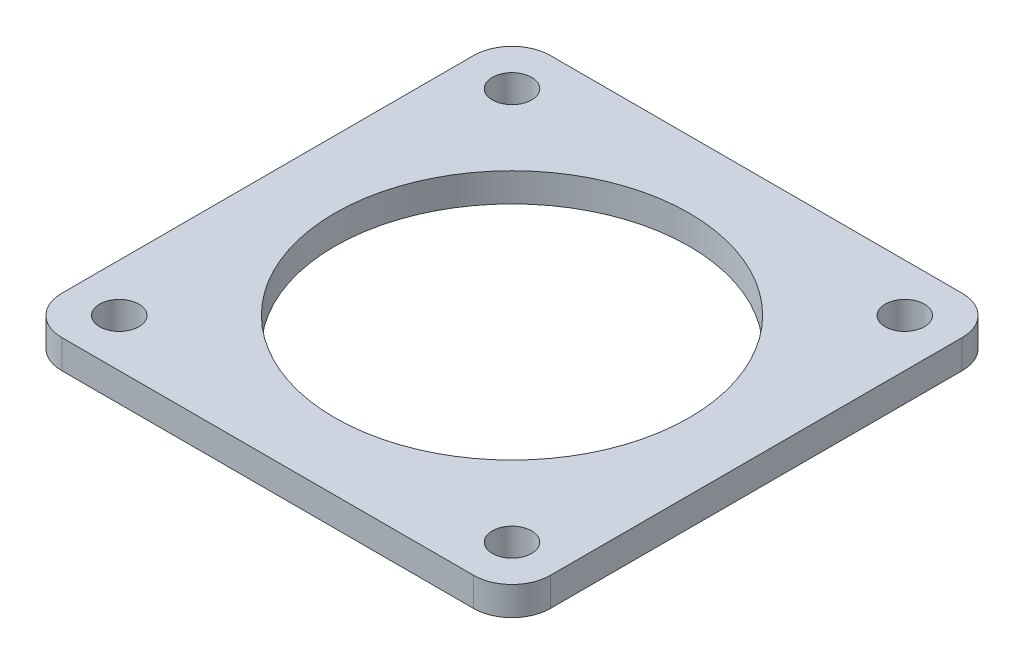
ISO-10303-21;
HEADER;
FILE_DESCRIPTION(('STEP AP214'),'2;1');
FILE_NAME('part.step','',(''),(''),'','','');
FILE_SCHEMA(('AUTOMOTIVE_DESIGN { 1 0 10303 214 1 1 1 1 }'));
ENDSEC;
DATA;
#1=APPLICATION_CONTEXT('core data for automotive mechanical design processes');
#2=APPLICATION_PROTOCOL_DEFINITION('international standard','automotive_design',2000,#1);
#3=PRODUCT_CONTEXT('',#1,'mechanical');
#4=PRODUCT('Part','Part','',(#3));
#5=PRODUCT_RELATED_PRODUCT_CATEGORY('part','',(#4));
#6=PRODUCT_DEFINITION_FORMATION('','',#4);
#7=PRODUCT_DEFINITION_CONTEXT('part definition',#1,'design');
#8=PRODUCT_DEFINITION('design','',#6,#7);
#9=PRODUCT_DEFINITION_SHAPE('','',#8);
#10=(LENGTH_UNIT() NAMED_UNIT(*) SI_UNIT(.MILLI.,.METRE.));
#11=(NAMED_UNIT(*) PLANE_ANGLE_UNIT() SI_UNIT($,.RADIAN.));
#12=(NAMED_UNIT(*) SI_UNIT($,.STERADIAN.) SOLID_ANGLE_UNIT());
#13=UNCERTAINTY_MEASURE_WITH_UNIT(LENGTH_MEASURE(1.E-05),#10,'distance_accuracy_value','');
#14=(GEOMETRIC_REPRESENTATION_CONTEXT(3) GLOBAL_UNCERTAINTY_ASSIGNED_CONTEXT((#13)) GLOBAL_UNIT_ASSIGNED_CONTEXT((#10,
#11,#12)) REPRESENTATION_CONTEXT('',''));
#15=CARTESIAN_POINT('',(0.,0.,0.));
#16=DIRECTION('',(0.,0.,1.));
#17=DIRECTION('',(1.,0.,0.));
#18=AXIS2_PLACEMENT_3D('',#15,#16,#17);
#19=CARTESIAN_POINT('',(0.,3.,0.));
#20=DIRECTION('',(0.,-1.,0.));
#21=DIRECTION('',(0.,0.,-1.));
#22=AXIS2_PLACEMENT_3D('',#19,#20,#21);
#23=PLANE('',#22);
#24=DIRECTION('',(1.,0.,0.));
#25=VECTOR('',#24,1.);
#26=CARTESIAN_POINT('',(-25.5,3.,25.5));
#27=LINE('',#26,#25);
#28=CARTESIAN_POINT('',(-21.5,3.,25.5));
#29=VERTEX_POINT('',#28);
#30=CARTESIAN_POINT('',(21.5,3.,25.5));
#31=VERTEX_POINT('',#30);
#32=EDGE_CURVE('E137',#29,#31,#27,.T.);
#33=ORIENTED_EDGE('',*,*,#32,.T.);
#34=CARTESIAN_POINT('',(21.5,3.,21.5));
#35=DIRECTION('',(0.,-1.,0.));
#36=DIRECTION('',(0.,0.,-1.));
#37=AXIS2_PLACEMENT_3D('',#34,#35,#36);
#38=CIRCLE('',#37,4.);
#39=CARTESIAN_POINT('',(25.5,3.,21.5));
#40=VERTEX_POINT('',#39);
#41=EDGE_CURVE('E155',#31,#40,#38,.F.);
#42=ORIENTED_EDGE('',*,*,#41,.T.);
#43=DIRECTION('',(0.,0.,-1.));
#44=VECTOR('',#43,1.);
#45=CARTESIAN_POINT('',(25.5,3.,25.5));
#46=LINE('',#45,#44);
#47=CARTESIAN_POINT('',(25.5,3.,-21.5));
#48=VERTEX_POINT('',#47);
#49=EDGE_CURVE('E119',#40,#48,#46,.T.);
#50=ORIENTED_EDGE('',*,*,#49,.T.);
#51=CARTESIAN_POINT('',(21.5,3.,-21.5));
#52=DIRECTION('',(0.,-1.,0.));
#53=DIRECTION('',(0.,0.,-1.));
#54=AXIS2_PLACEMENT_3D('',#51,#52,#53);
#55=CIRCLE('',#54,4.);
#56=CARTESIAN_POINT('',(21.5,3.,-25.5));
#57=VERTEX_POINT('',#56);
#58=EDGE_CURVE('E151',#48,#57,#55,.F.);
#59=ORIENTED_EDGE('',*,*,#58,.T.);
#60=DIRECTION('',(-1.,0.,0.));
#61=VECTOR('',#60,1.);
#62=CARTESIAN_POINT('',(-25.5,3.,-25.5));
#63=LINE('',#62,#61);
#64=CARTESIAN_POINT('',(-21.5,3.,-25.5));
#65=VERTEX_POINT('',#64);
#66=EDGE_CURVE('E164',#57,#65,#63,.T.);
#67=ORIENTED_EDGE('',*,*,#66,.T.);
#68=CARTESIAN_POINT('',(-21.5,3.,-21.5));
#69=DIRECTION('',(0.,-1.,0.));
#70=DIRECTION('',(0.,0.,-1.));
#71=AXIS2_PLACEMENT_3D('',#68,#69,#70);
#72=CIRCLE('',#71,4.);
#73=CARTESIAN_POINT('',(-25.5,3.,-21.5));
#74=VERTEX_POINT('',#73);
#75=EDGE_CURVE('E54',#65,#74,#72,.F.);
#76=ORIENTED_EDGE('',*,*,#75,.T.);
#77=DIRECTION('',(0.,0.,1.));
#78=VECTOR('',#77,1.);
#79=CARTESIAN_POINT('',(-25.5,3.,25.5));
#80=LINE('',#79,#78);
#81=CARTESIAN_POINT('',(-25.5,3.,21.5));
#82=VERTEX_POINT('',#81);
#83=EDGE_CURVE('E170',#74,#82,#80,.T.);
#84=ORIENTED_EDGE('',*,*,#83,.T.);
#85=CARTESIAN_POINT('',(-21.5,3.,21.5));
#86=DIRECTION('',(0.,-1.,0.));
#87=DIRECTION('',(0.,0.,-1.));
#88=AXIS2_PLACEMENT_3D('',#85,#86,#87);
#89=CIRCLE('',#88,4.);
#90=EDGE_CURVE('E153',#82,#29,#89,.F.);
#91=ORIENTED_EDGE('',*,*,#90,.T.);
#92=EDGE_LOOP('',(#33,#42,#50,#59,#67,#76,#84,#91));
#93=FACE_BOUND('',#92,.T.);
#94=CARTESIAN_POINT('',(0.,3.,0.));
#95=DIRECTION('',(0.,1.,0.));
#96=DIRECTION('',(0.,0.,1.));
#97=AXIS2_PLACEMENT_3D('',#94,#95,#96);
#98=CIRCLE('',#97,18.5);
#99=CARTESIAN_POINT('',(0.,3.,18.5));
#100=VERTEX_POINT('',#99);
#101=EDGE_CURVE('E134',#100,#100,#98,.T.);
#102=ORIENTED_EDGE('',*,*,#101,.F.);
#103=EDGE_LOOP('',(#102));
#104=FACE_BOUND('',#103,.T.);
#105=CARTESIAN_POINT('',(-20.5,3.,20.5));
#106=DIRECTION('',(0.,1.,0.));
#107=DIRECTION('',(0.,0.,1.));
#108=AXIS2_PLACEMENT_3D('',#105,#106,#107);
#109=CIRCLE('',#108,2.05);
#110=CARTESIAN_POINT('',(-20.5,3.,22.55));
#111=VERTEX_POINT('',#110);
#112=EDGE_CURVE('E189',#111,#111,#109,.T.);
#113=ORIENTED_EDGE('',*,*,#112,.F.);
#114=EDGE_LOOP('',(#113));
#115=FACE_BOUND('',#114,.T.);
#116=CARTESIAN_POINT('',(20.5,3.,20.5));
#117=DIRECTION('',(0.,1.,0.));
#118=DIRECTION('',(0.,0.,1.));
#119=AXIS2_PLACEMENT_3D('',#116,#117,#118);
#120=CIRCLE('',#119,2.05);
#121=CARTESIAN_POINT('',(20.5,3.,22.55));
#122=VERTEX_POINT('',#121);
#123=EDGE_CURVE('E195',#122,#122,#120,.T.);
#124=ORIENTED_EDGE('',*,*,#123,.F.);
#125=EDGE_LOOP('',(#124));
#126=FACE_BOUND('',#125,.T.);
#127=CARTESIAN_POINT('',(20.5,3.,-20.5));
#128=DIRECTION('',(0.,1.,0.));
#129=DIRECTION('',(0.,0.,1.));
#130=AXIS2_PLACEMENT_3D('',#127,#128,#129);
#131=CIRCLE('',#130,2.05);
#132=CARTESIAN_POINT('',(20.5,3.,-18.45));
#133=VERTEX_POINT('',#132);
#134=EDGE_CURVE('E201',#133,#133,#131,.T.);
#135=ORIENTED_EDGE('',*,*,#134,.F.);
#136=EDGE_LOOP('',(#135));
#137=FACE_BOUND('',#136,.T.);
#138=CARTESIAN_POINT('',(-20.5,3.,-20.5));
#139=DIRECTION('',(0.,1.,0.));
#140=DIRECTION('',(0.,0.,1.));
#141=AXIS2_PLACEMENT_3D('',#138,#139,#140);
#142=CIRCLE('',#141,2.05);
#143=CARTESIAN_POINT('',(-20.5,3.,-18.45));
#144=VERTEX_POINT('',#143);
#145=EDGE_CURVE('E207',#144,#144,#142,.T.);
#146=ORIENTED_EDGE('',*,*,#145,.F.);
#147=EDGE_LOOP('',(#146));
#148=FACE_BOUND('',#147,.T.);
#149=ADVANCED_FACE('F32',(#93,#104,#115,#126,#137,#148),#23,.F.);
#150=CARTESIAN_POINT('',(0.,0.,0.));
#151=DIRECTION('',(0.,-1.,0.));
#152=DIRECTION('',(0.,0.,-1.));
#153=AXIS2_PLACEMENT_3D('',#150,#151,#152);
#154=PLANE('',#153);
#155=CARTESIAN_POINT('',(-20.5,0.,-20.5));
#156=DIRECTION('',(0.,1.,0.));
#157=DIRECTION('',(0.,0.,1.));
#158=AXIS2_PLACEMENT_3D('',#155,#156,#157);
#159=CIRCLE('',#158,2.05);
#160=CARTESIAN_POINT('',(-20.5,0.,-18.45));
#161=VERTEX_POINT('',#160);
#162=EDGE_CURVE('E204',#161,#161,#159,.T.);
#163=ORIENTED_EDGE('',*,*,#162,.T.);
#164=EDGE_LOOP('',(#163));
#165=FACE_BOUND('',#164,.T.);
#166=CARTESIAN_POINT('',(20.5,0.,-20.5));
#167=DIRECTION('',(0.,1.,0.));
#168=DIRECTION('',(0.,0.,1.));
#169=AXIS2_PLACEMENT_3D('',#166,#167,#168);
#170=CIRCLE('',#169,2.05);
#171=CARTESIAN_POINT('',(20.5,0.,-18.45));
#172=VERTEX_POINT('',#171);
#173=EDGE_CURVE('E198',#172,#172,#170,.T.);
#174=ORIENTED_EDGE('',*,*,#173,.T.);
#175=EDGE_LOOP('',(#174));
#176=FACE_BOUND('',#175,.T.);
#177=DIRECTION('',(0.,0.,-1.));
#178=VECTOR('',#177,1.);
#179=CARTESIAN_POINT('',(25.5,0.,25.5));
#180=LINE('',#179,#178);
#181=CARTESIAN_POINT('',(25.5,0.,21.5));
#182=VERTEX_POINT('',#181);
#183=CARTESIAN_POINT('',(25.5,0.,-21.5));
#184=VERTEX_POINT('',#183);
#185=EDGE_CURVE('E116',#182,#184,#180,.T.);
#186=ORIENTED_EDGE('',*,*,#185,.F.);
#187=CARTESIAN_POINT('',(21.5,0.,21.5));
#188=DIRECTION('',(0.,-1.,0.));
#189=DIRECTION('',(0.,0.,-1.));
#190=AXIS2_PLACEMENT_3D('',#187,#188,#189);
#191=CIRCLE('',#190,4.);
#192=CARTESIAN_POINT('',(21.5,0.,25.5));
#193=VERTEX_POINT('',#192);
#194=EDGE_CURVE('E99',#182,#193,#191,.T.);
#195=ORIENTED_EDGE('',*,*,#194,.T.);
#196=DIRECTION('',(1.,0.,0.));
#197=VECTOR('',#196,1.);
#198=CARTESIAN_POINT('',(-25.5,0.,25.5));
#199=LINE('',#198,#197);
#200=CARTESIAN_POINT('',(-21.5,0.,25.5));
#201=VERTEX_POINT('',#200);
#202=EDGE_CURVE('E141',#201,#193,#199,.T.);
#203=ORIENTED_EDGE('',*,*,#202,.F.);
#204=CARTESIAN_POINT('',(-21.5,0.,21.5));
#205=DIRECTION('',(0.,-1.,0.));
#206=DIRECTION('',(0.,0.,-1.));
#207=AXIS2_PLACEMENT_3D('',#204,#205,#206);
#208=CIRCLE('',#207,4.);
#209=CARTESIAN_POINT('',(-25.5,0.,21.5));
#210=VERTEX_POINT('',#209);
#211=EDGE_CURVE('E110',#201,#210,#208,.T.);
#212=ORIENTED_EDGE('',*,*,#211,.T.);
#213=DIRECTION('',(0.,0.,1.));
#214=VECTOR('',#213,1.);
#215=CARTESIAN_POINT('',(-25.5,0.,25.5));
#216=LINE('',#215,#214);
#217=CARTESIAN_POINT('',(-25.5,0.,-21.5));
#218=VERTEX_POINT('',#217);
#219=EDGE_CURVE('E131',#218,#210,#216,.T.);
#220=ORIENTED_EDGE('',*,*,#219,.F.);
#221=CARTESIAN_POINT('',(-21.5,0.,-21.5));
#222=DIRECTION('',(0.,-1.,0.));
#223=DIRECTION('',(0.,0.,-1.));
#224=AXIS2_PLACEMENT_3D('',#221,#222,#223);
#225=CIRCLE('',#224,4.);
#226=CARTESIAN_POINT('',(-21.5,0.,-25.5));
#227=VERTEX_POINT('',#226);
#228=EDGE_CURVE('E120',#218,#227,#225,.T.);
#229=ORIENTED_EDGE('',*,*,#228,.T.);
#230=DIRECTION('',(-1.,0.,0.));
#231=VECTOR('',#230,1.);
#232=CARTESIAN_POINT('',(-25.5,0.,-25.5));
#233=LINE('',#232,#231);
#234=CARTESIAN_POINT('',(21.5,0.,-25.5));
#235=VERTEX_POINT('',#234);
#236=EDGE_CURVE('E127',#235,#227,#233,.T.);
#237=ORIENTED_EDGE('',*,*,#236,.F.);
#238=CARTESIAN_POINT('',(21.5,0.,-21.5));
#239=DIRECTION('',(0.,-1.,0.));
#240=DIRECTION('',(0.,0.,-1.));
#241=AXIS2_PLACEMENT_3D('',#238,#239,#240);
#242=CIRCLE('',#241,4.);
#243=EDGE_CURVE('E126',#235,#184,#242,.T.);
#244=ORIENTED_EDGE('',*,*,#243,.T.);
#245=EDGE_LOOP('',(#186,#195,#203,#212,#220,#229,#237,#244));
#246=FACE_BOUND('',#245,.T.);
#247=CARTESIAN_POINT('',(0.,0.,0.));
#248=DIRECTION('',(0.,1.,0.));
#249=DIRECTION('',(0.,0.,1.));
#250=AXIS2_PLACEMENT_3D('',#247,#248,#249);
#251=CIRCLE('',#250,18.5);
#252=CARTESIAN_POINT('',(0.,0.,18.5));
#253=VERTEX_POINT('',#252);
#254=EDGE_CURVE('E128',#253,#253,#251,.T.);
#255=ORIENTED_EDGE('',*,*,#254,.T.);
#256=EDGE_LOOP('',(#255));
#257=FACE_BOUND('',#256,.T.);
#258=CARTESIAN_POINT('',(-20.5,0.,20.5));
#259=DIRECTION('',(0.,1.,0.));
#260=DIRECTION('',(0.,0.,1.));
#261=AXIS2_PLACEMENT_3D('',#258,#259,#260);
#262=CIRCLE('',#261,2.05);
#263=CARTESIAN_POINT('',(-20.5,0.,22.55));
#264=VERTEX_POINT('',#263);
#265=EDGE_CURVE('E185',#264,#264,#262,.T.);
#266=ORIENTED_EDGE('',*,*,#265,.T.);
#267=EDGE_LOOP('',(#266));
#268=FACE_BOUND('',#267,.T.);
#269=CARTESIAN_POINT('',(20.5,0.,20.5));
#270=DIRECTION('',(0.,1.,0.));
#271=DIRECTION('',(0.,0.,1.));
#272=AXIS2_PLACEMENT_3D('',#269,#270,#271);
#273=CIRCLE('',#272,2.05);
#274=CARTESIAN_POINT('',(20.5,0.,22.55));
#275=VERTEX_POINT('',#274);
#276=EDGE_CURVE('E192',#275,#275,#273,.T.);
#277=ORIENTED_EDGE('',*,*,#276,.T.);
#278=EDGE_LOOP('',(#277));
#279=FACE_BOUND('',#278,.T.);
#280=ADVANCED_FACE('F123',(#165,#176,#246,#257,#268,#279),#154,.T.);
#281=CARTESIAN_POINT('',(25.5,3.,25.5));
#282=DIRECTION('',(-1.,0.,0.));
#283=DIRECTION('',(0.,0.,1.));
#284=AXIS2_PLACEMENT_3D('',#281,#282,#283);
#285=PLANE('',#284);
#286=ORIENTED_EDGE('',*,*,#49,.F.);
#287=DIRECTION('',(0.,-1.,0.));
#288=VECTOR('',#287,1.);
#289=CARTESIAN_POINT('',(25.5,3.,21.5));
#290=LINE('',#289,#288);
#291=EDGE_CURVE('E103',#40,#182,#290,.T.);
#292=ORIENTED_EDGE('',*,*,#291,.T.);
#293=ORIENTED_EDGE('',*,*,#185,.T.);
#294=DIRECTION('',(0.,-1.,0.));
#295=VECTOR('',#294,1.);
#296=CARTESIAN_POINT('',(25.5,3.,-21.5));
#297=LINE('',#296,#295);
#298=EDGE_CURVE('E121',#184,#48,#297,.F.);
#299=ORIENTED_EDGE('',*,*,#298,.T.);
#300=EDGE_LOOP('',(#286,#292,#293,#299));
#301=FACE_BOUND('',#300,.T.);
#302=ADVANCED_FACE('F115',(#301),#285,.F.);
#303=CARTESIAN_POINT('',(-25.5,3.,-25.5));
#304=DIRECTION('',(0.,0.,1.));
#305=DIRECTION('',(1.,0.,0.));
#306=AXIS2_PLACEMENT_3D('',#303,#304,#305);
#307=PLANE('',#306);
#308=ORIENTED_EDGE('',*,*,#66,.F.);
#309=DIRECTION('',(0.,-1.,0.));
#310=VECTOR('',#309,1.);
#311=CARTESIAN_POINT('',(21.5,3.,-25.5));
#312=LINE('',#311,#310);
#313=EDGE_CURVE('E11',#57,#235,#312,.T.);
#314=ORIENTED_EDGE('',*,*,#313,.T.);
#315=ORIENTED_EDGE('',*,*,#236,.T.);
#316=DIRECTION('',(0.,-1.,0.));
#317=VECTOR('',#316,1.);
#318=CARTESIAN_POINT('',(-21.5,3.,-25.5));
#319=LINE('',#318,#317);
#320=EDGE_CURVE('E40',#227,#65,#319,.F.);
#321=ORIENTED_EDGE('',*,*,#320,.T.);
#322=EDGE_LOOP('',(#308,#314,#315,#321));
#323=FACE_BOUND('',#322,.T.);
#324=ADVANCED_FACE('F163',(#323),#307,.F.);
#325=CARTESIAN_POINT('',(-25.5,3.,25.5));
#326=DIRECTION('',(1.,0.,0.));
#327=DIRECTION('',(0.,0.,-1.));
#328=AXIS2_PLACEMENT_3D('',#325,#326,#327);
#329=PLANE('',#328);
#330=ORIENTED_EDGE('',*,*,#219,.T.);
#331=DIRECTION('',(0.,-1.,0.));
#332=VECTOR('',#331,1.);
#333=CARTESIAN_POINT('',(-25.5,3.,21.5));
#334=LINE('',#333,#332);
#335=EDGE_CURVE('E47',#210,#82,#334,.F.);
#336=ORIENTED_EDGE('',*,*,#335,.T.);
#337=ORIENTED_EDGE('',*,*,#83,.F.);
#338=DIRECTION('',(0.,-1.,0.));
#339=VECTOR('',#338,1.);
#340=CARTESIAN_POINT('',(-25.5,3.,-21.5));
#341=LINE('',#340,#339);
#342=EDGE_CURVE('E157',#74,#218,#341,.T.);
#343=ORIENTED_EDGE('',*,*,#342,.T.);
#344=EDGE_LOOP('',(#330,#336,#337,#343));
#345=FACE_BOUND('',#344,.T.);
#346=ADVANCED_FACE('F174',(#345),#329,.F.);
#347=CARTESIAN_POINT('',(-25.5,3.,25.5));
#348=DIRECTION('',(0.,0.,-1.));
#349=DIRECTION('',(-1.,0.,0.));
#350=AXIS2_PLACEMENT_3D('',#347,#348,#349);
#351=PLANE('',#350);
#352=ORIENTED_EDGE('',*,*,#202,.T.);
#353=DIRECTION('',(0.,-1.,0.));
#354=VECTOR('',#353,1.);
#355=CARTESIAN_POINT('',(21.5,3.,25.5));
#356=LINE('',#355,#354);
#357=EDGE_CURVE('E104',#193,#31,#356,.F.);
#358=ORIENTED_EDGE('',*,*,#357,.T.);
#359=ORIENTED_EDGE('',*,*,#32,.F.);
#360=DIRECTION('',(0.,-1.,0.));
#361=VECTOR('',#360,1.);
#362=CARTESIAN_POINT('',(-21.5,3.,25.5));
#363=LINE('',#362,#361);
#364=EDGE_CURVE('E109',#29,#201,#363,.T.);
#365=ORIENTED_EDGE('',*,*,#364,.T.);
#366=EDGE_LOOP('',(#352,#358,#359,#365));
#367=FACE_BOUND('',#366,.T.);
#368=ADVANCED_FACE('F181',(#367),#351,.F.);
#369=CARTESIAN_POINT('',(0.,0.,0.));
#370=DIRECTION('',(0.,1.,0.));
#371=DIRECTION('',(0.,0.,1.));
#372=AXIS2_PLACEMENT_3D('',#369,#370,#371);
#373=CYLINDRICAL_SURFACE('',#372,18.5);
#374=ORIENTED_EDGE('',*,*,#254,.F.);
#375=EDGE_LOOP('',(#374));
#376=FACE_BOUND('',#375,.T.);
#377=ORIENTED_EDGE('',*,*,#101,.T.);
#378=EDGE_LOOP('',(#377));
#379=FACE_BOUND('',#378,.T.);
#380=ADVANCED_FACE('F221',(#376,#379),#373,.F.);
#381=CARTESIAN_POINT('',(-20.5,3.,20.5));
#382=DIRECTION('',(0.,1.,0.));
#383=DIRECTION('',(0.,0.,1.));
#384=AXIS2_PLACEMENT_3D('',#381,#382,#383);
#385=CYLINDRICAL_SURFACE('',#384,2.05);
#386=ORIENTED_EDGE('',*,*,#265,.F.);
#387=EDGE_LOOP('',(#386));
#388=FACE_BOUND('',#387,.T.);
#389=ORIENTED_EDGE('',*,*,#112,.T.);
#390=EDGE_LOOP('',(#389));
#391=FACE_BOUND('',#390,.T.);
#392=ADVANCED_FACE('F325',(#388,#391),#385,.F.);
#393=CARTESIAN_POINT('',(20.5,3.,20.5));
#394=DIRECTION('',(0.,1.,0.));
#395=DIRECTION('',(0.,0.,1.));
#396=AXIS2_PLACEMENT_3D('',#393,#394,#395);
#397=CYLINDRICAL_SURFACE('',#396,2.05);
#398=ORIENTED_EDGE('',*,*,#276,.F.);
#399=EDGE_LOOP('',(#398));
#400=FACE_BOUND('',#399,.T.);
#401=ORIENTED_EDGE('',*,*,#123,.T.);
#402=EDGE_LOOP('',(#401));
#403=FACE_BOUND('',#402,.T.);
#404=ADVANCED_FACE('F315',(#400,#403),#397,.F.);
#405=CARTESIAN_POINT('',(20.5,3.,-20.5));
#406=DIRECTION('',(0.,1.,0.));
#407=DIRECTION('',(0.,0.,1.));
#408=AXIS2_PLACEMENT_3D('',#405,#406,#407);
#409=CYLINDRICAL_SURFACE('',#408,2.05);
#410=ORIENTED_EDGE('',*,*,#173,.F.);
#411=EDGE_LOOP('',(#410));
#412=FACE_BOUND('',#411,.T.);
#413=ORIENTED_EDGE('',*,*,#134,.T.);
#414=EDGE_LOOP('',(#413));
#415=FACE_BOUND('',#414,.T.);
#416=ADVANCED_FACE('F305',(#412,#415),#409,.F.);
#417=CARTESIAN_POINT('',(-20.5,3.,-20.5));
#418=DIRECTION('',(0.,1.,0.));
#419=DIRECTION('',(0.,0.,1.));
#420=AXIS2_PLACEMENT_3D('',#417,#418,#419);
#421=CYLINDRICAL_SURFACE('',#420,2.05);
#422=ORIENTED_EDGE('',*,*,#162,.F.);
#423=EDGE_LOOP('',(#422));
#424=FACE_BOUND('',#423,.T.);
#425=ORIENTED_EDGE('',*,*,#145,.T.);
#426=EDGE_LOOP('',(#425));
#427=FACE_BOUND('',#426,.T.);
#428=ADVANCED_FACE('F211',(#424,#427),#421,.F.);
#429=CARTESIAN_POINT('',(21.5,3.,21.5));
#430=DIRECTION('',(0.,-1.,0.));
#431=DIRECTION('',(0.,0.,-1.));
#432=AXIS2_PLACEMENT_3D('',#429,#430,#431);
#433=CYLINDRICAL_SURFACE('',#432,4.);
#434=ORIENTED_EDGE('',*,*,#41,.F.);
#435=ORIENTED_EDGE('',*,*,#357,.F.);
#436=ORIENTED_EDGE('',*,*,#194,.F.);
#437=ORIENTED_EDGE('',*,*,#291,.F.);
#438=EDGE_LOOP('',(#434,#435,#436,#437));
#439=FACE_BOUND('',#438,.T.);
#440=ADVANCED_FACE('F102',(#439),#433,.T.);
#441=CARTESIAN_POINT('',(-21.5,3.,21.5));
#442=DIRECTION('',(0.,-1.,0.));
#443=DIRECTION('',(0.,0.,-1.));
#444=AXIS2_PLACEMENT_3D('',#441,#442,#443);
#445=CYLINDRICAL_SURFACE('',#444,4.);
#446=ORIENTED_EDGE('',*,*,#90,.F.);
#447=ORIENTED_EDGE('',*,*,#335,.F.);
#448=ORIENTED_EDGE('',*,*,#211,.F.);
#449=ORIENTED_EDGE('',*,*,#364,.F.);
#450=EDGE_LOOP('',(#446,#447,#448,#449));
#451=FACE_BOUND('',#450,.T.);
#452=ADVANCED_FACE('F178',(#451),#445,.T.);
#453=CARTESIAN_POINT('',(21.5,3.,-21.5));
#454=DIRECTION('',(0.,-1.,0.));
#455=DIRECTION('',(0.,0.,-1.));
#456=AXIS2_PLACEMENT_3D('',#453,#454,#455);
#457=CYLINDRICAL_SURFACE('',#456,4.);
#458=ORIENTED_EDGE('',*,*,#58,.F.);
#459=ORIENTED_EDGE('',*,*,#298,.F.);
#460=ORIENTED_EDGE('',*,*,#243,.F.);
#461=ORIENTED_EDGE('',*,*,#313,.F.);
#462=EDGE_LOOP('',(#458,#459,#460,#461));
#463=FACE_BOUND('',#462,.T.);
#464=ADVANCED_FACE('F235',(#463),#457,.T.);
#465=CARTESIAN_POINT('',(-21.5,3.,-21.5));
#466=DIRECTION('',(0.,-1.,0.));
#467=DIRECTION('',(0.,0.,-1.));
#468=AXIS2_PLACEMENT_3D('',#465,#466,#467);
#469=CYLINDRICAL_SURFACE('',#468,4.);
#470=ORIENTED_EDGE('',*,*,#75,.F.);
#471=ORIENTED_EDGE('',*,*,#320,.F.);
#472=ORIENTED_EDGE('',*,*,#228,.F.);
#473=ORIENTED_EDGE('',*,*,#342,.F.);
#474=EDGE_LOOP('',(#470,#471,#472,#473));
#475=FACE_BOUND('',#474,.T.);
#476=ADVANCED_FACE('F34',(#475),#469,.T.);
#477=CLOSED_SHELL('',(#149,#280,#302,#324,#346,#368,#380,#392,#404,#416,#428,#440,#452,#464,#476));
#478=MANIFOLD_SOLID_BREP('B2',#477);
#479=ADVANCED_BREP_SHAPE_REPRESENTATION('',(#18,#478),#14);
#480=SHAPE_DEFINITION_REPRESENTATION(#9,#479);
ENDSEC;
END-ISO-10303-21;
